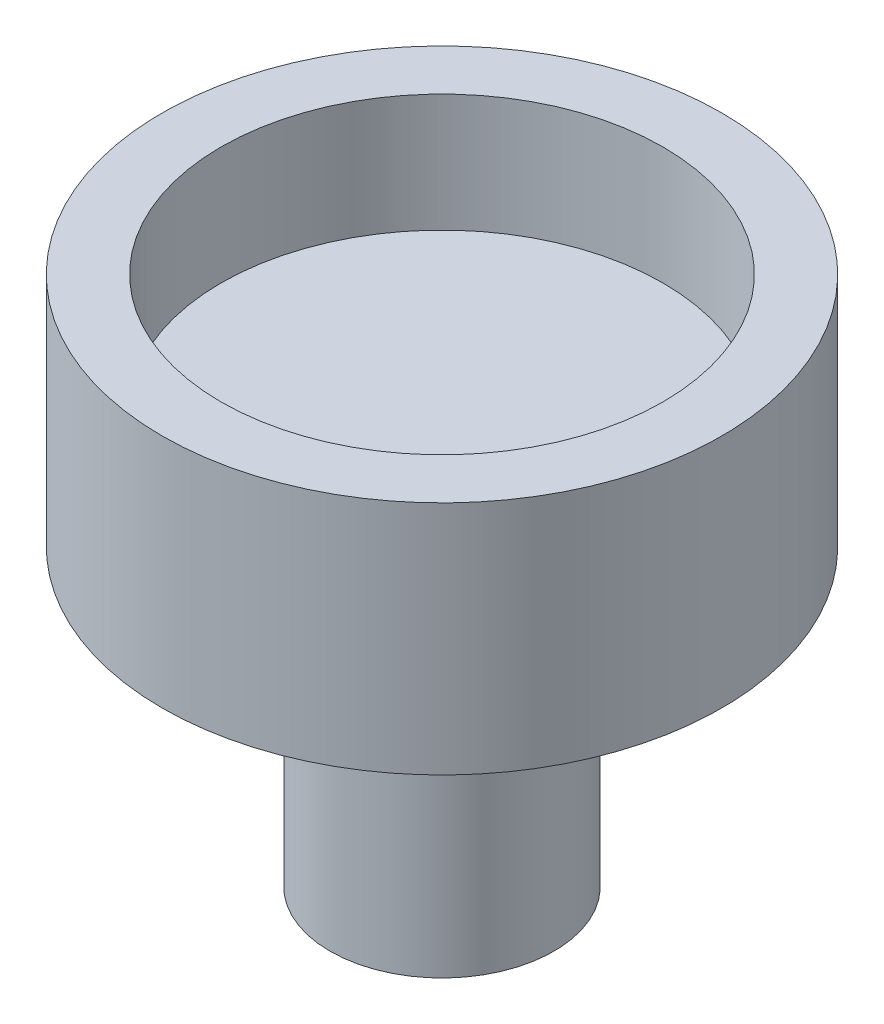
from build123d import *


with BuildPart() as part:
    # Sketch1 → Revolve1 (revolve)
    with BuildSketch(Plane.XY, mode=Mode.PRIVATE) as revolve1_sk:
        Polygon((-1.5875, 6.35), (-6.0325, 6.35), (-6.0325, 11.43), (-4.7625, 11.43), (-4.7625, 8.89), (0, 8.89), (0, 0), (-2.413, 0), (-2.413, 5.08), (-1.5875, 5.08), align=None)
    revolve(revolve1_sk.sketch.rotate(Axis((0, 0, 0), (0, 1, 0)), 270), axis=Axis((0, 0, 0), (0, 1, 0)))


solid = part.part
